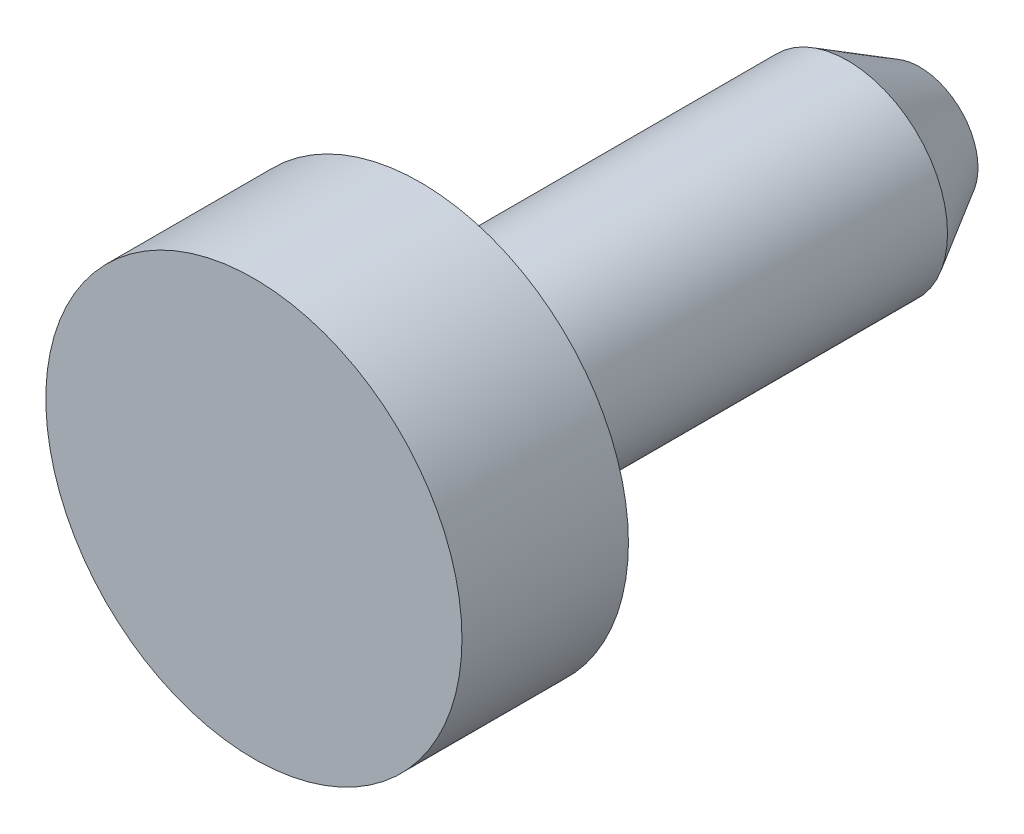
ISO-10303-21;
HEADER;
FILE_DESCRIPTION(('STEP AP214'),'2;1');
FILE_NAME('part.step','',(''),(''),'','','');
FILE_SCHEMA(('AUTOMOTIVE_DESIGN { 1 0 10303 214 1 1 1 1 }'));
ENDSEC;
DATA;
#1=APPLICATION_CONTEXT('core data for automotive mechanical design processes');
#2=APPLICATION_PROTOCOL_DEFINITION('international standard','automotive_design',2000,#1);
#3=PRODUCT_CONTEXT('',#1,'mechanical');
#4=PRODUCT('Part','Part','',(#3));
#5=PRODUCT_RELATED_PRODUCT_CATEGORY('part','',(#4));
#6=PRODUCT_DEFINITION_FORMATION('','',#4);
#7=PRODUCT_DEFINITION_CONTEXT('part definition',#1,'design');
#8=PRODUCT_DEFINITION('design','',#6,#7);
#9=PRODUCT_DEFINITION_SHAPE('','',#8);
#10=(LENGTH_UNIT() NAMED_UNIT(*) SI_UNIT(.MILLI.,.METRE.));
#11=(NAMED_UNIT(*) PLANE_ANGLE_UNIT() SI_UNIT($,.RADIAN.));
#12=(NAMED_UNIT(*) SI_UNIT($,.STERADIAN.) SOLID_ANGLE_UNIT());
#13=UNCERTAINTY_MEASURE_WITH_UNIT(LENGTH_MEASURE(1.E-05),#10,'distance_accuracy_value','');
#14=(GEOMETRIC_REPRESENTATION_CONTEXT(3) GLOBAL_UNCERTAINTY_ASSIGNED_CONTEXT((#13)) GLOBAL_UNIT_ASSIGNED_CONTEXT((#10,
#11,#12)) REPRESENTATION_CONTEXT('',''));
#15=CARTESIAN_POINT('',(0.,0.,0.));
#16=DIRECTION('',(0.,0.,1.));
#17=DIRECTION('',(1.,0.,0.));
#18=AXIS2_PLACEMENT_3D('',#15,#16,#17);
#19=CARTESIAN_POINT('',(0.,0.,2.));
#20=DIRECTION('',(0.,0.,-1.));
#21=DIRECTION('',(-1.,0.,0.));
#22=AXIS2_PLACEMENT_3D('',#19,#20,#21);
#23=CYLINDRICAL_SURFACE('',#22,2.5);
#24=CARTESIAN_POINT('',(0.,0.,2.));
#25=DIRECTION('',(0.,0.,1.));
#26=DIRECTION('',(1.,0.,0.));
#27=AXIS2_PLACEMENT_3D('',#24,#25,#26);
#28=CIRCLE('',#27,2.5);
#29=CARTESIAN_POINT('',(2.5,0.,2.));
#30=VERTEX_POINT('',#29);
#31=EDGE_CURVE('E42',#30,#30,#28,.T.);
#32=ORIENTED_EDGE('',*,*,#31,.F.);
#33=EDGE_LOOP('',(#32));
#34=FACE_BOUND('',#33,.T.);
#35=CARTESIAN_POINT('',(0.,0.,0.));
#36=DIRECTION('',(0.,0.,1.));
#37=DIRECTION('',(1.,0.,0.));
#38=AXIS2_PLACEMENT_3D('',#35,#36,#37);
#39=CIRCLE('',#38,2.5);
#40=CARTESIAN_POINT('',(2.5,0.,0.));
#41=VERTEX_POINT('',#40);
#42=EDGE_CURVE('E46',#41,#41,#39,.T.);
#43=ORIENTED_EDGE('',*,*,#42,.T.);
#44=EDGE_LOOP('',(#43));
#45=FACE_BOUND('',#44,.T.);
#46=ADVANCED_FACE('F31',(#34,#45),#23,.T.);
#47=CARTESIAN_POINT('',(0.,0.,2.));
#48=DIRECTION('',(0.,0.,1.));
#49=DIRECTION('',(1.,0.,0.));
#50=AXIS2_PLACEMENT_3D('',#47,#48,#49);
#51=PLANE('',#50);
#52=ORIENTED_EDGE('',*,*,#31,.T.);
#53=EDGE_LOOP('',(#52));
#54=FACE_BOUND('',#53,.T.);
#55=ADVANCED_FACE('F67',(#54),#51,.T.);
#56=CARTESIAN_POINT('',(0.,0.,0.));
#57=DIRECTION('',(0.,0.,1.));
#58=DIRECTION('',(1.,0.,0.));
#59=AXIS2_PLACEMENT_3D('',#56,#57,#58);
#60=PLANE('',#59);
#61=CARTESIAN_POINT('',(0.,0.,0.));
#62=DIRECTION('',(0.,0.,1.));
#63=DIRECTION('',(1.,0.,0.));
#64=AXIS2_PLACEMENT_3D('',#61,#62,#63);
#65=CIRCLE('',#64,1.2);
#66=CARTESIAN_POINT('',(1.2,0.,0.));
#67=VERTEX_POINT('',#66);
#68=EDGE_CURVE('E50',#67,#67,#65,.T.);
#69=ORIENTED_EDGE('',*,*,#68,.T.);
#70=EDGE_LOOP('',(#69));
#71=FACE_BOUND('',#70,.T.);
#72=ORIENTED_EDGE('',*,*,#42,.F.);
#73=EDGE_LOOP('',(#72));
#74=FACE_BOUND('',#73,.T.);
#75=ADVANCED_FACE('F55',(#71,#74),#60,.F.);
#76=CARTESIAN_POINT('',(0.,0.,-6.));
#77=DIRECTION('',(0.,0.,1.));
#78=DIRECTION('',(1.,0.,0.));
#79=AXIS2_PLACEMENT_3D('',#76,#77,#78);
#80=CYLINDRICAL_SURFACE('',#79,1.2);
#81=CARTESIAN_POINT('',(0.,0.,-5.13397459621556));
#82=DIRECTION('',(0.,0.,1.));
#83=DIRECTION('',(1.,0.,0.));
#84=AXIS2_PLACEMENT_3D('',#81,#82,#83);
#85=CIRCLE('',#84,1.2);
#86=CARTESIAN_POINT('',(1.2,0.,-5.13397459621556));
#87=VERTEX_POINT('',#86);
#88=EDGE_CURVE('E38',#87,#87,#85,.T.);
#89=ORIENTED_EDGE('',*,*,#88,.T.);
#90=EDGE_LOOP('',(#89));
#91=FACE_BOUND('',#90,.T.);
#92=ORIENTED_EDGE('',*,*,#68,.F.);
#93=EDGE_LOOP('',(#92));
#94=FACE_BOUND('',#93,.T.);
#95=ADVANCED_FACE('F58',(#91,#94),#80,.T.);
#96=CARTESIAN_POINT('',(0.,0.,-6.));
#97=DIRECTION('',(0.,0.,1.));
#98=DIRECTION('',(1.,0.,0.));
#99=AXIS2_PLACEMENT_3D('',#96,#97,#98);
#100=PLANE('',#99);
#101=CARTESIAN_POINT('',(0.,0.,-6.));
#102=DIRECTION('',(0.,0.,1.));
#103=DIRECTION('',(1.,0.,0.));
#104=AXIS2_PLACEMENT_3D('',#101,#102,#103);
#105=CIRCLE('',#104,0.699999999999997);
#106=CARTESIAN_POINT('',(0.699999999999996,0.,-6.));
#107=VERTEX_POINT('',#106);
#108=EDGE_CURVE('E10',#107,#107,#105,.F.);
#109=ORIENTED_EDGE('',*,*,#108,.T.);
#110=EDGE_LOOP('',(#109));
#111=FACE_BOUND('',#110,.T.);
#112=ADVANCED_FACE('F60',(#111),#100,.F.);
#113=CARTESIAN_POINT('',(0.,0.,-5.13397459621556));
#114=DIRECTION('',(0.,0.,1.));
#115=DIRECTION('',(1.,0.,0.));
#116=AXIS2_PLACEMENT_3D('',#113,#114,#115);
#117=CONICAL_SURFACE('',#116,1.2,0.523598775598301);
#118=CARTESIAN_POINT('',(0.699999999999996,0.,-6.));
#119=CARTESIAN_POINT('',(0.70520833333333,0.,-5.99097890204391));
#120=CARTESIAN_POINT('',(0.710416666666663,0.,-5.98195780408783));
#121=CARTESIAN_POINT('',(0.72083333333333,0.,-5.96391560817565));
#122=CARTESIAN_POINT('',(0.726041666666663,0.,-5.95489451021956));
#123=CARTESIAN_POINT('',(0.73645833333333,0.,-5.93685231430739));
#124=CARTESIAN_POINT('',(0.741666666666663,0.,-5.9278312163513));
#125=CARTESIAN_POINT('',(0.75208333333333,0.,-5.90978902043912));
#126=CARTESIAN_POINT('',(0.757291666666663,0.,-5.90076792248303));
#127=CARTESIAN_POINT('',(0.76770833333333,0.,-5.88272572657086));
#128=CARTESIAN_POINT('',(0.772916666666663,0.,-5.87370462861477));
#129=CARTESIAN_POINT('',(0.78333333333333,0.,-5.85566243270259));
#130=CARTESIAN_POINT('',(0.788541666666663,0.,-5.84664133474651));
#131=CARTESIAN_POINT('',(0.79895833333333,0.,-5.82859913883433));
#132=CARTESIAN_POINT('',(0.804166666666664,0.,-5.81957804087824));
#133=CARTESIAN_POINT('',(0.81458333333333,0.,-5.80153584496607));
#134=CARTESIAN_POINT('',(0.819791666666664,0.,-5.79251474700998));
#135=CARTESIAN_POINT('',(0.83020833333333,0.,-5.7744725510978));
#136=CARTESIAN_POINT('',(0.835416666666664,0.,-5.76545145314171));
#137=CARTESIAN_POINT('',(0.845833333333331,0.,-5.74740925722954));
#138=CARTESIAN_POINT('',(0.851041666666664,0.,-5.73838815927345));
#139=CARTESIAN_POINT('',(0.861458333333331,0.,-5.72034596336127));
#140=CARTESIAN_POINT('',(0.866666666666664,0.,-5.71132486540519));
#141=CARTESIAN_POINT('',(0.877083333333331,0.,-5.69328266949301));
#142=CARTESIAN_POINT('',(0.882291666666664,0.,-5.68426157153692));
#143=CARTESIAN_POINT('',(0.892708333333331,0.,-5.66621937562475));
#144=CARTESIAN_POINT('',(0.897916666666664,0.,-5.65719827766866));
#145=CARTESIAN_POINT('',(0.908333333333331,0.,-5.63915608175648));
#146=CARTESIAN_POINT('',(0.913541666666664,0.,-5.6301349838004));
#147=CARTESIAN_POINT('',(0.923958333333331,0.,-5.61209278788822));
#148=CARTESIAN_POINT('',(0.929166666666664,0.,-5.60307168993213));
#149=CARTESIAN_POINT('',(0.939583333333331,0.,-5.58502949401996));
#150=CARTESIAN_POINT('',(0.944791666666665,0.,-5.57600839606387));
#151=CARTESIAN_POINT('',(0.955208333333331,0.,-5.55796620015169));
#152=CARTESIAN_POINT('',(0.960416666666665,0.,-5.5489451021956));
#153=CARTESIAN_POINT('',(0.970833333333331,0.,-5.53090290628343));
#154=CARTESIAN_POINT('',(0.976041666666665,0.,-5.52188180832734));
#155=CARTESIAN_POINT('',(0.986458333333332,0.,-5.50383961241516));
#156=CARTESIAN_POINT('',(0.991666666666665,0.,-5.49481851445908));
#157=CARTESIAN_POINT('',(1.00208333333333,0.,-5.4767763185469));
#158=CARTESIAN_POINT('',(1.00729166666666,0.,-5.46775522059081));
#159=CARTESIAN_POINT('',(1.01770833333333,0.,-5.44971302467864));
#160=CARTESIAN_POINT('',(1.02291666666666,0.,-5.44069192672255));
#161=CARTESIAN_POINT('',(1.03333333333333,0.,-5.42264973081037));
#162=CARTESIAN_POINT('',(1.03854166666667,0.,-5.41362863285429));
#163=CARTESIAN_POINT('',(1.04895833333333,0.,-5.39558643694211));
#164=CARTESIAN_POINT('',(1.05416666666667,0.,-5.38656533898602));
#165=CARTESIAN_POINT('',(1.06458333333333,0.,-5.36852314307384));
#166=CARTESIAN_POINT('',(1.06979166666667,0.,-5.35950204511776));
#167=CARTESIAN_POINT('',(1.08020833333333,0.,-5.34145984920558));
#168=CARTESIAN_POINT('',(1.08541666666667,0.,-5.33243875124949));
#169=CARTESIAN_POINT('',(1.09583333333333,0.,-5.31439655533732));
#170=CARTESIAN_POINT('',(1.10104166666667,0.,-5.30537545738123));
#171=CARTESIAN_POINT('',(1.11145833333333,0.,-5.28733326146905));
#172=CARTESIAN_POINT('',(1.11666666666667,0.,-5.27831216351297));
#173=CARTESIAN_POINT('',(1.12708333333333,0.,-5.26026996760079));
#174=CARTESIAN_POINT('',(1.13229166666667,0.,-5.2512488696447));
#175=CARTESIAN_POINT('',(1.14270833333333,0.,-5.23320667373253));
#176=CARTESIAN_POINT('',(1.14791666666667,0.,-5.22418557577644));
#177=CARTESIAN_POINT('',(1.15833333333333,0.,-5.20614337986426));
#178=CARTESIAN_POINT('',(1.16354166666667,0.,-5.19712228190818));
#179=CARTESIAN_POINT('',(1.17395833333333,0.,-5.179080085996));
#180=CARTESIAN_POINT('',(1.17916666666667,0.,-5.17005898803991));
#181=CARTESIAN_POINT('',(1.18958333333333,0.,-5.15201679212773));
#182=CARTESIAN_POINT('',(1.19479166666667,0.,-5.14299569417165));
#183=CARTESIAN_POINT('',(1.2,0.,-5.13397459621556));
#184=B_SPLINE_CURVE_WITH_KNOTS('',3,(#118,#119,#120,#121,#122,#123,#124,#125,#126,#127,#128,
#129,#130,#131,#132,#133,#134,#135,#136,#137,#138,#139,#140,#141,#142,#143,#144,#145,#146,#147,
#148,#149,#150,#151,#152,#153,#154,#155,#156,#157,#158,#159,#160,#161,#162,#163,#164,#165,#166,
#167,#168,#169,#170,#171,#172,#173,#174,#175,#176,#177,#178,#179,#180,#181,#182,#183),
.UNSPECIFIED.,.F.,.F.,(4,2,2,2,2,2,2,2,2,2,2,2,2,2,2,2,2,2,2,2,2,2,2,2,2,2,2,2,2,2,2,2,4),(0.,
0.0312500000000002,0.0625000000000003,0.0937500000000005,0.125000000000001,0.156250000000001,
0.187500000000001,0.218750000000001,0.250000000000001,0.281250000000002,0.312500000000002,
0.343750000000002,0.375000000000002,0.406250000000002,0.437500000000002,0.468750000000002,
0.500000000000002,0.531250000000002,0.562500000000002,0.593750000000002,0.625000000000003,
0.656250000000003,0.687500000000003,0.718750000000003,0.750000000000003,0.781250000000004,
0.812500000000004,0.843750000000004,0.875000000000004,0.906250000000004,0.937500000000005,
0.968750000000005,1.),.UNSPECIFIED.);
#185=EDGE_CURVE('BSEAM33',#107,#87,#184,.T.);
#186=ORIENTED_EDGE('',*,*,#108,.F.);
#187=ORIENTED_EDGE('',*,*,#88,.F.);
#188=ORIENTED_EDGE('',*,*,#185,.T.);
#189=ORIENTED_EDGE('',*,*,#185,.F.);
#190=EDGE_LOOP('',(#186,#188,#187,#189));
#191=FACE_BOUND('',#190,.T.);
#192=ADVANCED_FACE('F33',(#191),#117,.T.);
#193=CLOSED_SHELL('',(#46,#55,#75,#95,#112,#192));
#194=MANIFOLD_SOLID_BREP('B2',#193);
#195=ADVANCED_BREP_SHAPE_REPRESENTATION('',(#18,#194),#14);
#196=SHAPE_DEFINITION_REPRESENTATION(#9,#195);
ENDSEC;
END-ISO-10303-21;
